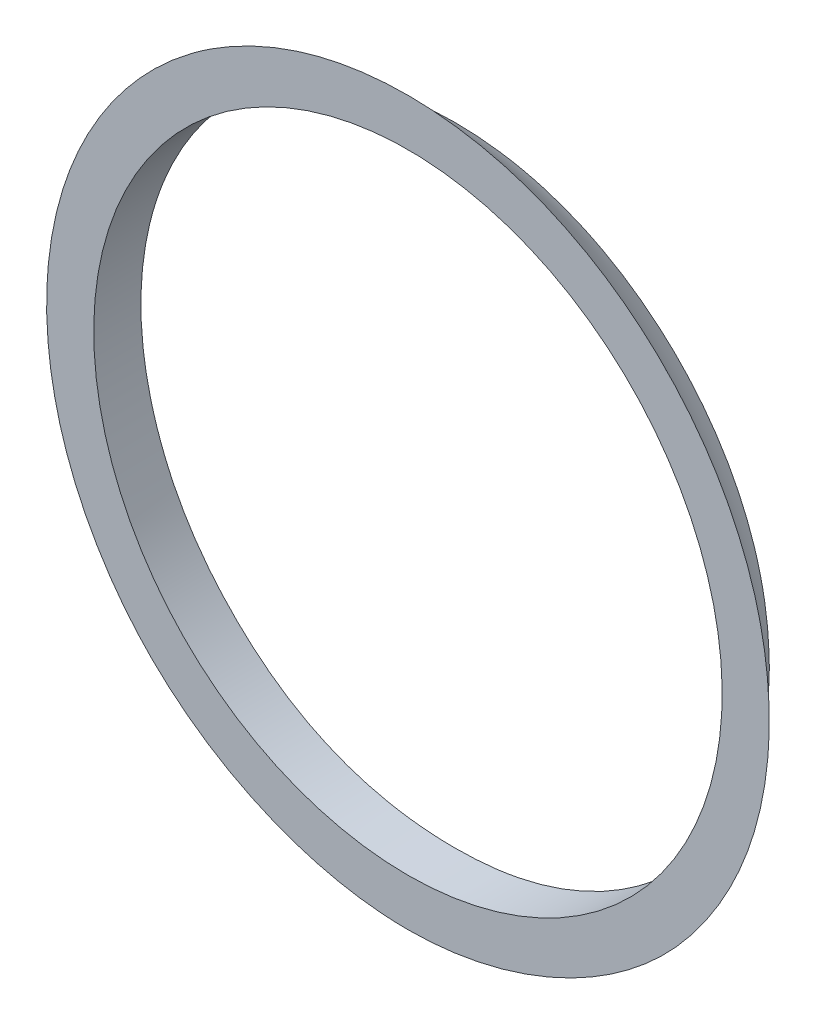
ISO-10303-21;
HEADER;
FILE_DESCRIPTION(('STEP AP214'),'2;1');
FILE_NAME('part.step','',(''),(''),'','','');
FILE_SCHEMA(('AUTOMOTIVE_DESIGN { 1 0 10303 214 1 1 1 1 }'));
ENDSEC;
DATA;
#1=APPLICATION_CONTEXT('core data for automotive mechanical design processes');
#2=APPLICATION_PROTOCOL_DEFINITION('international standard','automotive_design',2000,#1);
#3=PRODUCT_CONTEXT('',#1,'mechanical');
#4=PRODUCT('Part','Part','',(#3));
#5=PRODUCT_RELATED_PRODUCT_CATEGORY('part','',(#4));
#6=PRODUCT_DEFINITION_FORMATION('','',#4);
#7=PRODUCT_DEFINITION_CONTEXT('part definition',#1,'design');
#8=PRODUCT_DEFINITION('design','',#6,#7);
#9=PRODUCT_DEFINITION_SHAPE('','',#8);
#10=(LENGTH_UNIT() NAMED_UNIT(*) SI_UNIT(.MILLI.,.METRE.));
#11=(NAMED_UNIT(*) PLANE_ANGLE_UNIT() SI_UNIT($,.RADIAN.));
#12=(NAMED_UNIT(*) SI_UNIT($,.STERADIAN.) SOLID_ANGLE_UNIT());
#13=UNCERTAINTY_MEASURE_WITH_UNIT(LENGTH_MEASURE(1.E-05),#10,'distance_accuracy_value','');
#14=(GEOMETRIC_REPRESENTATION_CONTEXT(3) GLOBAL_UNCERTAINTY_ASSIGNED_CONTEXT((#13)) GLOBAL_UNIT_ASSIGNED_CONTEXT((#10,
#11,#12)) REPRESENTATION_CONTEXT('',''));
#15=CARTESIAN_POINT('',(0.,0.,0.));
#16=DIRECTION('',(0.,0.,1.));
#17=DIRECTION('',(1.,0.,0.));
#18=AXIS2_PLACEMENT_3D('',#15,#16,#17);
#19=CARTESIAN_POINT('',(370.257977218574,-413.045415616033,-147.499999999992));
#20=DIRECTION('',(0.,0.,1.));
#21=DIRECTION('',(-0.325224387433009,-0.945636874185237,0.));
#22=AXIS2_PLACEMENT_3D('',#19,#20,#21);
#23=PLANE('',#22);
#24=CARTESIAN_POINT('',(324.151711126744,-462.488037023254,-147.499999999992));
#25=CARTESIAN_POINT('',(324.77450577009,-462.488044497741,-147.499999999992));
#26=CARTESIAN_POINT('',(325.397181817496,-462.460550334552,-147.499999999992));
#27=CARTESIAN_POINT('',(326.638158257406,-462.352873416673,-147.499999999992));
#28=CARTESIAN_POINT('',(327.256457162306,-462.272673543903,-147.499999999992));
#29=CARTESIAN_POINT('',(328.485669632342,-462.061692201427,-147.499999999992));
#30=CARTESIAN_POINT('',(329.096564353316,-461.930801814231,-147.499999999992));
#31=CARTESIAN_POINT('',(330.305931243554,-461.620688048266,-147.499999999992));
#32=CARTESIAN_POINT('',(330.904404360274,-461.441468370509,-147.499999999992));
#33=CARTESIAN_POINT('',(331.887314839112,-461.104638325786,-147.499999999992));
#34=CARTESIAN_POINT('',(332.276233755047,-460.959931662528,-147.499999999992));
#35=CARTESIAN_POINT('',(333.046086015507,-460.650590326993,-147.499999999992));
#36=CARTESIAN_POINT('',(333.42701937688,-460.485955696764,-147.499999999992));
#37=CARTESIAN_POINT('',(334.17987943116,-460.137249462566,-147.499999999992));
#38=CARTESIAN_POINT('',(334.551806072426,-459.953177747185,-147.499999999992));
#39=CARTESIAN_POINT('',(335.285228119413,-459.566250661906,-147.499999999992));
#40=CARTESIAN_POINT('',(335.646734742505,-459.363416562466,-147.499999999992));
#41=CARTESIAN_POINT('',(336.358696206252,-458.939187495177,-147.499999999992));
#42=CARTESIAN_POINT('',(336.709150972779,-458.717792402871,-147.499999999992));
#43=CARTESIAN_POINT('',(337.397929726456,-458.256790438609,-147.499999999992));
#44=CARTESIAN_POINT('',(337.736252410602,-458.017181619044,-147.499999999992));
#45=CARTESIAN_POINT('',(338.426527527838,-457.499907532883,-147.499999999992));
#46=CARTESIAN_POINT('',(338.7773498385,-457.220732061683,-147.499999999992));
#47=CARTESIAN_POINT('',(339.461793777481,-456.641970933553,-147.499999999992));
#48=CARTESIAN_POINT('',(339.795415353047,-456.342385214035,-147.499999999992));
#49=CARTESIAN_POINT('',(340.281537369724,-455.878135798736,-147.499999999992));
#50=CARTESIAN_POINT('',(340.441192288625,-455.720908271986,-147.499999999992));
#51=CARTESIAN_POINT('',(340.755560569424,-455.401588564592,-147.499999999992));
#52=CARTESIAN_POINT('',(340.910273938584,-455.239496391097,-147.499999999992));
#53=CARTESIAN_POINT('',(341.366987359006,-454.746075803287,-147.499999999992));
#54=CARTESIAN_POINT('',(341.661444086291,-454.407714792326,-147.499999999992));
#55=CARTESIAN_POINT('',(342.229559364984,-453.71389262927,-147.499999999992));
#56=CARTESIAN_POINT('',(342.503214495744,-453.358428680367,-147.499999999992));
#57=CARTESIAN_POINT('',(342.897776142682,-452.81377200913,-147.499999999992));
#58=CARTESIAN_POINT('',(343.026647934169,-452.630302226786,-147.499999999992));
#59=CARTESIAN_POINT('',(343.279113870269,-452.259713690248,-147.499999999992));
#60=CARTESIAN_POINT('',(343.402706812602,-452.072594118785,-147.499999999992));
#61=CARTESIAN_POINT('',(343.864534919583,-451.351130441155,-147.499999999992));
#62=CARTESIAN_POINT('',(344.184059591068,-450.804610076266,-147.499999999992));
#63=CARTESIAN_POINT('',(344.777451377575,-449.687359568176,-147.499999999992));
#64=CARTESIAN_POINT('',(345.051315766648,-449.116627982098,-147.499999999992));
#65=CARTESIAN_POINT('',(345.550661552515,-447.954617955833,-147.499999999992));
#66=CARTESIAN_POINT('',(345.776162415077,-447.36334789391,-147.499999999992));
#67=CARTESIAN_POINT('',(346.176690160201,-446.163824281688,-147.499999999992));
#68=CARTESIAN_POINT('',(346.351713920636,-445.555569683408,-147.499999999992));
#69=CARTESIAN_POINT('',(346.5769076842,-444.628271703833,-147.499999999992));
#70=CARTESIAN_POINT('',(346.646203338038,-444.313750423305,-147.499999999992));
#71=CARTESIAN_POINT('',(346.771433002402,-443.682041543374,-147.499999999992));
#72=CARTESIAN_POINT('',(346.827367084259,-443.364853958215,-147.499999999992));
#73=CARTESIAN_POINT('',(346.926006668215,-442.728428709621,-147.499999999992));
#74=CARTESIAN_POINT('',(346.968711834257,-442.409190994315,-147.499999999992));
#75=CARTESIAN_POINT('',(347.040906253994,-441.769221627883,-147.499999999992));
#76=CARTESIAN_POINT('',(347.070395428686,-441.448489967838,-147.499999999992));
#77=CARTESIAN_POINT('',(347.116099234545,-440.805966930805,-147.499999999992));
#78=CARTESIAN_POINT('',(347.132309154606,-440.484175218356,-147.499999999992));
#79=CARTESIAN_POINT('',(347.15123130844,-439.84019798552,-147.499999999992));
#80=CARTESIAN_POINT('',(347.153943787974,-439.518012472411,-147.499999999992));
#81=CARTESIAN_POINT('',(347.145761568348,-438.873812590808,-147.499999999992));
#82=CARTESIAN_POINT('',(347.134866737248,-438.551798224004,-147.499999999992));
#83=CARTESIAN_POINT('',(347.099727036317,-437.908493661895,-147.499999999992));
#84=CARTESIAN_POINT('',(347.075481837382,-437.587203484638,-147.499999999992));
#85=CARTESIAN_POINT('',(347.013431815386,-436.942769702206,-147.499999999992));
#86=CARTESIAN_POINT('',(346.975496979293,-436.619638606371,-147.499999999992));
#87=CARTESIAN_POINT('',(346.886134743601,-435.975251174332,-147.499999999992));
#88=CARTESIAN_POINT('',(346.834707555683,-435.653994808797,-147.499999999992));
#89=CARTESIAN_POINT('',(346.71824849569,-435.013971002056,-147.499999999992));
#90=CARTESIAN_POINT('',(346.653217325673,-434.695203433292,-147.499999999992));
#91=CARTESIAN_POINT('',(346.509473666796,-434.060761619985,-147.499999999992));
#92=CARTESIAN_POINT('',(346.43076097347,-433.745087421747,-147.499999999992));
#93=CARTESIAN_POINT('',(346.25981041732,-433.117535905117,-147.499999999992));
#94=CARTESIAN_POINT('',(346.16757708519,-432.805657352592,-147.499999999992));
#95=CARTESIAN_POINT('',(345.969749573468,-432.186166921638,-147.499999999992));
#96=CARTESIAN_POINT('',(345.864155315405,-431.87855506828,-147.499999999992));
#97=CARTESIAN_POINT('',(345.63987318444,-431.268162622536,-147.499999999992));
#98=CARTESIAN_POINT('',(345.521186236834,-430.965381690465,-147.499999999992));
#99=CARTESIAN_POINT('',(345.271037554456,-430.365079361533,-147.499999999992));
#100=CARTESIAN_POINT('',(345.139572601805,-430.067559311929,-147.499999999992));
#101=CARTESIAN_POINT('',(344.729710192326,-429.190764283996,-147.499999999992));
#102=CARTESIAN_POINT('',(344.433120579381,-428.619862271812,-147.499999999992));
#103=CARTESIAN_POINT('',(343.793301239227,-427.504912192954,-147.499999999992));
#104=CARTESIAN_POINT('',(343.450071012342,-426.960864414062,-147.499999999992));
#105=CARTESIAN_POINT('',(342.719167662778,-425.903219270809,-147.499999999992));
#106=CARTESIAN_POINT('',(342.331481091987,-425.389631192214,-147.499999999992));
#107=CARTESIAN_POINT('',(341.514657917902,-424.39653076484,-147.499999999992));
#108=CARTESIAN_POINT('',(341.085519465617,-423.917019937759,-147.499999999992));
#109=CARTESIAN_POINT('',(340.184881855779,-422.991121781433,-147.499999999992));
#110=CARTESIAN_POINT('',(339.713036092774,-422.5450715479,-147.499999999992));
#111=CARTESIAN_POINT('',(338.733575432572,-421.694155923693,-147.499999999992));
#112=CARTESIAN_POINT('',(338.225961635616,-421.289289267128,-147.499999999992));
#113=CARTESIAN_POINT('',(337.178554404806,-420.523946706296,-147.499999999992));
#114=CARTESIAN_POINT('',(336.638770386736,-420.163457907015,-147.499999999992));
#115=CARTESIAN_POINT('',(335.530600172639,-419.489260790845,-147.499999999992));
#116=CARTESIAN_POINT('',(334.962212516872,-419.17555486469,-147.499999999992));
#117=CARTESIAN_POINT('',(334.091084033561,-418.741671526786,-147.499999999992));
#118=CARTESIAN_POINT('',(333.79738325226,-418.603063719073,-147.499999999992));
#119=CARTESIAN_POINT('',(333.204364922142,-418.338390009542,-147.499999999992));
#120=CARTESIAN_POINT('',(332.905047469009,-418.212323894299,-147.499999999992));
#121=CARTESIAN_POINT('',(332.301337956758,-417.97306561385,-147.499999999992));
#122=CARTESIAN_POINT('',(331.996946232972,-417.859872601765,-147.499999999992));
#123=CARTESIAN_POINT('',(331.383579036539,-417.646663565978,-147.499999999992));
#124=CARTESIAN_POINT('',(331.074603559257,-417.546647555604,-147.499999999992));
#125=CARTESIAN_POINT('',(330.452575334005,-417.360007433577,-147.499999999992));
#126=CARTESIAN_POINT('',(330.13952188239,-417.273385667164,-147.499999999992));
#127=CARTESIAN_POINT('',(329.509937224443,-417.113701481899,-147.499999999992));
#128=CARTESIAN_POINT('',(329.193405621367,-417.040640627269,-147.499999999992));
#129=CARTESIAN_POINT('',(328.557484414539,-416.908162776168,-147.499999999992));
#130=CARTESIAN_POINT('',(328.238094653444,-416.848746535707,-147.499999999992));
#131=CARTESIAN_POINT('',(327.597133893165,-416.743420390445,-147.499999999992));
#132=CARTESIAN_POINT('',(327.275563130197,-416.697509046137,-147.499999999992));
#133=CARTESIAN_POINT('',(326.634565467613,-416.619594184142,-147.499999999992));
#134=CARTESIAN_POINT('',(326.315157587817,-416.587434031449,-147.499999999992));
#135=CARTESIAN_POINT('',(325.675292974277,-416.53629735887,-147.499999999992));
#136=CARTESIAN_POINT('',(325.354836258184,-416.517320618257,-147.499999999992));
#137=CARTESIAN_POINT('',(324.713411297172,-416.492700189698,-147.499999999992));
#138=CARTESIAN_POINT('',(324.392443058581,-416.487056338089,-147.499999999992));
#139=CARTESIAN_POINT('',(323.750555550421,-416.489299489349,-147.499999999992));
#140=CARTESIAN_POINT('',(323.429636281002,-416.49718653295,-147.499999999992));
#141=CARTESIAN_POINT('',(322.788445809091,-416.526249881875,-147.499999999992));
#142=CARTESIAN_POINT('',(322.468174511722,-416.547424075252,-147.499999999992));
#143=CARTESIAN_POINT('',(321.828803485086,-416.602937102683,-147.499999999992));
#144=CARTESIAN_POINT('',(321.509703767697,-416.637276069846,-147.499999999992));
#145=CARTESIAN_POINT('',(320.554907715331,-416.759983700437,-147.499999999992));
#146=CARTESIAN_POINT('',(319.921563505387,-416.868049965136,-147.499999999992));
#147=CARTESIAN_POINT('',(318.975355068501,-417.071120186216,-147.499999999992));
#148=CARTESIAN_POINT('',(318.658100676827,-417.146399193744,-147.499999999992));
#149=CARTESIAN_POINT('',(318.027152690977,-417.31061014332,-147.499999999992));
#150=CARTESIAN_POINT('',(317.713458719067,-417.39954062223,-147.499999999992));
#151=CARTESIAN_POINT('',(317.090187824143,-417.590894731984,-147.499999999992));
#152=CARTESIAN_POINT('',(316.780611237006,-417.693319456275,-147.499999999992));
#153=CARTESIAN_POINT('',(316.166178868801,-417.911405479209,-147.499999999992));
#154=CARTESIAN_POINT('',(315.861323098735,-418.027066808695,-147.499999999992));
#155=CARTESIAN_POINT('',(314.954601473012,-418.393401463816,-147.499999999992));
#156=CARTESIAN_POINT('',(314.360438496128,-418.663469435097,-147.499999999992));
#157=CARTESIAN_POINT('',(313.197226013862,-419.252946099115,-147.499999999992));
#158=CARTESIAN_POINT('',(312.628176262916,-419.572354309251,-147.499999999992));
#159=CARTESIAN_POINT('',(311.527903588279,-420.252939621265,-147.499999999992));
#160=CARTESIAN_POINT('',(310.996227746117,-420.613384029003,-147.499999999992));
#161=CARTESIAN_POINT('',(309.96481803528,-421.377369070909,-147.499999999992));
#162=CARTESIAN_POINT('',(309.465083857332,-421.780909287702,-147.499999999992));
#163=CARTESIAN_POINT('',(308.500783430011,-422.628128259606,-147.499999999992));
#164=CARTESIAN_POINT('',(308.036221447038,-423.071811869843,-147.499999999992));
#165=CARTESIAN_POINT('',(307.145466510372,-423.996149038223,-147.499999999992));
#166=CARTESIAN_POINT('',(306.71927346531,-424.476802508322,-147.499999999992));
#167=CARTESIAN_POINT('',(305.903073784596,-425.478388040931,-147.499999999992));
#168=CARTESIAN_POINT('',(305.513609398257,-425.999762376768,-147.499999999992));
#169=CARTESIAN_POINT('',(304.780212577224,-427.073609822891,-147.499999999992));
#170=CARTESIAN_POINT('',(304.436281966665,-427.626084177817,-147.499999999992));
#171=CARTESIAN_POINT('',(303.796402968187,-428.758078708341,-147.499999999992));
#172=CARTESIAN_POINT('',(303.50044311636,-429.337592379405,-147.499999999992));
#173=CARTESIAN_POINT('',(303.094144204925,-430.223898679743,-147.499999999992));
#174=CARTESIAN_POINT('',(302.964976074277,-430.522197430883,-147.499999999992));
#175=CARTESIAN_POINT('',(302.719429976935,-431.124046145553,-147.499999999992));
#176=CARTESIAN_POINT('',(302.603052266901,-431.427596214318,-147.499999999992));
#177=CARTESIAN_POINT('',(302.38396866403,-432.03793428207,-147.499999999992));
#178=CARTESIAN_POINT('',(302.281199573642,-432.344699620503,-147.499999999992));
#179=CARTESIAN_POINT('',(302.088927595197,-432.962329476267,-147.499999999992));
#180=CARTESIAN_POINT('',(301.999423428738,-433.273193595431,-147.499999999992));
#181=CARTESIAN_POINT('',(301.833831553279,-433.898503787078,-147.499999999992));
#182=CARTESIAN_POINT('',(301.757745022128,-434.212950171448,-147.499999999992));
#183=CARTESIAN_POINT('',(301.619107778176,-434.844811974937,-147.499999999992));
#184=CARTESIAN_POINT('',(301.556557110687,-435.162227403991,-147.499999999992));
#185=CARTESIAN_POINT('',(301.444874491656,-435.799462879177,-147.499999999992));
#186=CARTESIAN_POINT('',(301.395744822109,-436.11928332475,-147.499999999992));
#187=CARTESIAN_POINT('',(301.310828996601,-436.76069109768,-147.499999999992));
#188=CARTESIAN_POINT('',(301.275042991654,-437.082278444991,-147.499999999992));
#189=CARTESIAN_POINT('',(301.216851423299,-437.726664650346,-147.499999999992));
#190=CARTESIAN_POINT('',(301.19444566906,-438.049463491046,-147.499999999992));
#191=CARTESIAN_POINT('',(301.16312476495,-438.695681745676,-147.499999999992));
#192=CARTESIAN_POINT('',(301.154209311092,-439.019101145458,-147.499999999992));
#193=CARTESIAN_POINT('',(301.148105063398,-439.987446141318,-147.499999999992));
#194=CARTESIAN_POINT('',(301.171357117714,-440.632663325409,-147.499999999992));
#195=CARTESIAN_POINT('',(301.246130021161,-441.597123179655,-147.499999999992));
#196=CARTESIAN_POINT('',(301.277710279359,-441.918091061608,-147.499999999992));
#197=CARTESIAN_POINT('',(301.354120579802,-442.558475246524,-147.499999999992));
#198=CARTESIAN_POINT('',(301.398950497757,-442.877891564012,-147.499999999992));
#199=CARTESIAN_POINT('',(301.501892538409,-443.514578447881,-147.499999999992));
#200=CARTESIAN_POINT('',(301.560004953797,-443.831848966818,-147.499999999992));
#201=CARTESIAN_POINT('',(301.689656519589,-444.463642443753,-147.499999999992));
#202=CARTESIAN_POINT('',(301.761195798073,-444.778165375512,-147.499999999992));
#203=CARTESIAN_POINT('',(301.917656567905,-445.403820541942,-147.499999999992));
#204=CARTESIAN_POINT('',(302.002576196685,-445.714953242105,-147.499999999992));
#205=CARTESIAN_POINT('',(302.185680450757,-446.333293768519,-147.499999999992));
#206=CARTESIAN_POINT('',(302.283865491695,-446.640501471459,-147.499999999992));
#207=CARTESIAN_POINT('',(302.528349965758,-447.352471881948,-147.499999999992));
#208=CARTESIAN_POINT('',(302.679757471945,-447.755491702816,-147.499999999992));
#209=CARTESIAN_POINT('',(303.005191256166,-448.552321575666,-147.499999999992));
#210=CARTESIAN_POINT('',(303.179219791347,-448.946130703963,-147.499999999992));
#211=CARTESIAN_POINT('',(303.549074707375,-449.723417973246,-147.499999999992));
#212=CARTESIAN_POINT('',(303.744903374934,-450.106895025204,-147.499999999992));
#213=CARTESIAN_POINT('',(304.157461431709,-450.862292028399,-147.499999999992));
#214=CARTESIAN_POINT('',(304.374183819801,-451.234215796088,-147.499999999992));
#215=CARTESIAN_POINT('',(304.714332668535,-451.782686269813,-147.499999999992));
#216=CARTESIAN_POINT('',(304.830228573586,-451.963943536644,-147.499999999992));
#217=CARTESIAN_POINT('',(305.066940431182,-452.323216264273,-147.499999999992));
#218=CARTESIAN_POINT('',(305.187756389,-452.501231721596,-147.499999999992));
#219=CARTESIAN_POINT('',(305.557516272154,-453.030138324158,-147.499999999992));
#220=CARTESIAN_POINT('',(305.813804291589,-453.375941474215,-147.499999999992));
#221=CARTESIAN_POINT('',(306.347470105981,-454.054602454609,-147.499999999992));
#222=CARTESIAN_POINT('',(306.624977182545,-454.387358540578,-147.499999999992));
#223=CARTESIAN_POINT('',(307.199080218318,-455.035987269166,-147.499999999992));
#224=CARTESIAN_POINT('',(307.49567575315,-455.351860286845,-147.499999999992));
#225=CARTESIAN_POINT('',(308.107229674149,-455.965265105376,-147.499999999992));
#226=CARTESIAN_POINT('',(308.422187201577,-456.262797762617,-147.499999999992));
#227=CARTESIAN_POINT('',(309.06896448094,-456.839072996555,-147.499999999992));
#228=CARTESIAN_POINT('',(309.400788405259,-457.117810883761,-147.499999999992));
#229=CARTESIAN_POINT('',(310.079753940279,-457.656037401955,-147.499999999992));
#230=CARTESIAN_POINT('',(310.42689732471,-457.915523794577,-147.499999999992));
#231=CARTESIAN_POINT('',(311.135051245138,-458.414788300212,-147.499999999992));
#232=CARTESIAN_POINT('',(311.496062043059,-458.654566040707,-147.499999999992));
#233=CARTESIAN_POINT('',(312.399944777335,-459.219881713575,-147.499999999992));
#234=CARTESIAN_POINT('',(312.949984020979,-459.534043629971,-147.499999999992));
#235=CARTESIAN_POINT('',(314.073036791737,-460.118005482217,-147.499999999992));
#236=CARTESIAN_POINT('',(314.646049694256,-460.387806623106,-147.499999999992));
#237=CARTESIAN_POINT('',(315.811270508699,-460.881360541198,-147.499999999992));
#238=CARTESIAN_POINT('',(316.403468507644,-461.105136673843,-147.499999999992));
#239=CARTESIAN_POINT('',(317.603610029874,-461.50487402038,-147.499999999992));
#240=CARTESIAN_POINT('',(318.211550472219,-461.680844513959,-147.499999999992));
#241=CARTESIAN_POINT('',(319.696580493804,-462.046077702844,-147.499999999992));
#242=CARTESIAN_POINT('',(320.58000430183,-462.210179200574,-147.499999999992));
#243=CARTESIAN_POINT('',(322.359612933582,-462.431102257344,-147.499999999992));
#244=CARTESIAN_POINT('',(323.25578474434,-462.48802627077,-147.499999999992));
#245=CARTESIAN_POINT('',(324.151711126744,-462.488037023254,-147.499999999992));
#246=B_SPLINE_CURVE_WITH_KNOTS('',3,(#24,#25,#26,#27,#28,#29,#30,#31,#32,#33,#34,#35,#36,#37,
#38,#39,#40,#41,#42,#43,#44,#45,#46,#47,#48,#49,#50,#51,#52,#53,#54,#55,#56,#57,#58,#59,#60,#61,
#62,#63,#64,#65,#66,#67,#68,#69,#70,#71,#72,#73,#74,#75,#76,#77,#78,#79,#80,#81,#82,#83,#84,#85,
#86,#87,#88,#89,#90,#91,#92,#93,#94,#95,#96,#97,#98,#99,#100,#101,#102,#103,#104,#105,#106,#107,
#108,#109,#110,#111,#112,#113,#114,#115,#116,#117,#118,#119,#120,#121,#122,#123,#124,#125,#126,
#127,#128,#129,#130,#131,#132,#133,#134,#135,#136,#137,#138,#139,#140,#141,#142,#143,#144,#145,
#146,#147,#148,#149,#150,#151,#152,#153,#154,#155,#156,#157,#158,#159,#160,#161,#162,#163,#164,
#165,#166,#167,#168,#169,#170,#171,#172,#173,#174,#175,#176,#177,#178,#179,#180,#181,#182,#183,
#184,#185,#186,#187,#188,#189,#190,#191,#192,#193,#194,#195,#196,#197,#198,#199,#200,#201,#202,
#203,#204,#205,#206,#207,#208,#209,#210,#211,#212,#213,#214,#215,#216,#217,#218,#219,#220,#221,
#222,#223,#224,#225,#226,#227,#228,#229,#230,#231,#232,#233,#234,#235,#236,#237,#238,#239,#240,
#241,#242,#243,#244,#245),.UNSPECIFIED.,.T.,.F.,(4,2,2,2,2,2,2,2,2,2,2,2,2,2,2,2,2,2,2,2,2,2,2,
2,2,2,2,2,2,2,2,2,2,2,2,2,2,2,2,2,2,2,2,2,2,2,2,2,2,2,2,2,2,2,2,2,2,2,2,2,2,2,2,2,2,2,2,2,2,2,2,
2,2,2,2,2,2,2,2,2,2,2,2,2,2,2,2,2,2,2,2,2,2,2,2,2,2,2,2,2,2,2,2,2,2,2,2,2,2,2,4),(0.,
1.86762920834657,3.73586529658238,5.60813809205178,7.48026755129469,8.72466558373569,
9.96906099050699,11.2134635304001,12.4564722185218,13.6994892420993,14.942639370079,
16.286918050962,17.6312008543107,18.3033361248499,18.9754704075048,20.3202221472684,
21.6651945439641,22.3377335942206,23.010425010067,24.9073292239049,26.8043466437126,
28.7005990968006,30.5969688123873,31.5629220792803,32.5288701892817,33.4948428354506,
34.460821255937,35.4271422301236,36.3934456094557,37.3597583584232,38.3260949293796,
39.3018615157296,40.2776127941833,41.2533137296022,42.2290292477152,43.2044185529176,
44.1798135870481,45.1551397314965,46.1307121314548,48.0582973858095,49.9859032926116,
51.9140938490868,53.8423704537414,55.7880081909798,57.7335861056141,59.6785973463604,
61.6237079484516,62.5977653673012,63.5718062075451,64.5457829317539,65.5197606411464,
66.4939086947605,67.4681690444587,68.4424833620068,69.4166937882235,70.3794909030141,
71.342271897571,72.3050410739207,73.2678131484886,74.2304322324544,75.1930610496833,
77.1178665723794,78.0958194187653,79.0736675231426,80.0515949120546,81.0295245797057,
82.9849371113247,84.9403305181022,86.8650925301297,88.7898359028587,90.7148123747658,
92.6397842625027,94.5897726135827,96.539839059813,98.4894387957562,99.4643913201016,
100.439363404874,101.409635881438,102.379814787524,103.350078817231,104.320346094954,
105.290778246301,106.261221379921,107.231650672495,108.202058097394,110.136251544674,
111.103604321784,112.070948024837,113.038313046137,114.005687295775,114.972927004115,
115.940197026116,117.231032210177,118.52199629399,119.813095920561,121.10376441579,
121.749120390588,122.394477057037,123.685007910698,124.984147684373,126.283258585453,
127.582308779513,128.881681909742,130.181205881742,131.480754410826,133.378949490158,
135.277092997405,137.174270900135,139.071080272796,141.76034577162,144.447039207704),.UNSPECIFIED.);
#247=CARTESIAN_POINT('',(324.151711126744,-462.488037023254,-147.499999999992));
#248=VERTEX_POINT('',#247);
#249=EDGE_CURVE('E61',#248,#248,#246,.T.);
#250=ORIENTED_EDGE('',*,*,#249,.T.);
#251=EDGE_LOOP('',(#250));
#252=FACE_BOUND('',#251,.T.);
#253=CARTESIAN_POINT('',(324.151711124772,-439.488037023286,-147.499999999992));
#254=DIRECTION('',(0.,0.,1.));
#255=DIRECTION('',(0.,-1.,0.));
#256=AXIS2_PLACEMENT_3D('',#253,#254,#255);
#257=CIRCLE('',#256,20.);
#258=CARTESIAN_POINT('',(324.151711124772,-459.488037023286,-147.499999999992));
#259=VERTEX_POINT('',#258);
#260=EDGE_CURVE('E71',#259,#259,#257,.T.);
#261=ORIENTED_EDGE('',*,*,#260,.F.);
#262=EDGE_LOOP('',(#261));
#263=FACE_BOUND('',#262,.T.);
#264=ADVANCED_FACE('F54',(#252,#263),#23,.T.);
#265=CARTESIAN_POINT('',(324.151711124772,-439.488037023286,-152.49999999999));
#266=DIRECTION('',(0.,0.,0.999999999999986));
#267=DIRECTION('',(0.782222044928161,0.622999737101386,0.));
#268=AXIS2_PLACEMENT_3D('',#265,#266,#267);
#269=CYLINDRICAL_SURFACE('',#268,20.);
#270=CARTESIAN_POINT('',(324.151711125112,-459.488037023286,-150.500000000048));
#271=CARTESIAN_POINT('',(323.590778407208,-459.488033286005,-150.500001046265));
#272=CARTESIAN_POINT('',(323.029741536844,-459.46441811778,-150.496684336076));
#273=CARTESIAN_POINT('',(321.911571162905,-459.37010822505,-150.48676199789));
#274=CARTESIAN_POINT('',(321.35443880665,-459.299400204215,-150.480155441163));
#275=CARTESIAN_POINT('',(320.247475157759,-459.111300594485,-150.466517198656));
#276=CARTESIAN_POINT('',(319.697652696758,-458.99385705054,-150.459485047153));
#277=CARTESIAN_POINT('',(318.609821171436,-458.71309635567,-150.447181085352));
#278=CARTESIAN_POINT('',(318.071811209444,-458.549782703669,-150.441909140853));
#279=CARTESIAN_POINT('',(317.188114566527,-458.240337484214,-150.435716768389));
#280=CARTESIAN_POINT('',(316.838040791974,-458.106592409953,-150.433931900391));
#281=CARTESIAN_POINT('',(316.145923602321,-457.819640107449,-150.431934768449));
#282=CARTESIAN_POINT('',(315.803880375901,-457.66643242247,-150.431722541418));
#283=CARTESIAN_POINT('',(315.128948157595,-457.341051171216,-150.432906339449));
#284=CARTESIAN_POINT('',(314.796059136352,-457.168877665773,-150.434302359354));
#285=CARTESIAN_POINT('',(314.140553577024,-456.806149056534,-150.438559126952));
#286=CARTESIAN_POINT('',(313.817934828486,-456.615597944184,-150.441419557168));
#287=CARTESIAN_POINT('',(313.183914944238,-456.216686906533,-150.448283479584));
#288=CARTESIAN_POINT('',(312.872513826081,-456.008326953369,-150.452286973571));
#289=CARTESIAN_POINT('',(312.261906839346,-455.574454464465,-150.460928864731));
#290=CARTESIAN_POINT('',(311.96270102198,-455.348941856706,-150.465567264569));
#291=CARTESIAN_POINT('',(311.37766423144,-454.881664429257,-150.47477417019));
#292=CARTESIAN_POINT('',(311.091822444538,-454.639913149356,-150.479342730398));
#293=CARTESIAN_POINT('',(310.534145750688,-454.140748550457,-150.487525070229));
#294=CARTESIAN_POINT('',(310.262310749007,-453.883335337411,-150.49113885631));
#295=CARTESIAN_POINT('',(309.733503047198,-453.353653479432,-150.496329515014));
#296=CARTESIAN_POINT('',(309.476530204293,-453.081384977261,-150.497906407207));
#297=CARTESIAN_POINT('',(308.978261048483,-452.522855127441,-150.49957066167));
#298=CARTESIAN_POINT('',(308.736965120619,-452.236593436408,-150.499657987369));
#299=CARTESIAN_POINT('',(308.270801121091,-451.650962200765,-150.499146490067));
#300=CARTESIAN_POINT('',(308.045933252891,-451.351592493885,-150.498547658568));
#301=CARTESIAN_POINT('',(307.721518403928,-450.893465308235,-150.497900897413));
#302=CARTESIAN_POINT('',(307.615524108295,-450.739238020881,-150.497727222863));
#303=CARTESIAN_POINT('',(307.407902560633,-450.42786786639,-150.497582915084));
#304=CARTESIAN_POINT('',(307.306275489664,-450.270724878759,-150.497612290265));
#305=CARTESIAN_POINT('',(306.908449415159,-449.63620950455,-150.498076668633));
#306=CARTESIAN_POINT('',(306.630007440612,-449.147521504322,-150.499205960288));
#307=CARTESIAN_POINT('',(306.11527885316,-448.148458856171,-150.502113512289));
#308=CARTESIAN_POINT('',(305.878992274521,-447.638084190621,-150.503891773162));
#309=CARTESIAN_POINT('',(305.557443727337,-446.859075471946,-150.506010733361));
#310=CARTESIAN_POINT('',(305.455731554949,-446.59713470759,-150.506625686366));
#311=CARTESIAN_POINT('',(305.263428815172,-446.069200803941,-150.507530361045));
#312=CARTESIAN_POINT('',(305.172838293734,-445.80320764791,-150.507820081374));
#313=CARTESIAN_POINT('',(304.918015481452,-444.999885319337,-150.508085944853));
#314=CARTESIAN_POINT('',(304.770683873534,-444.457096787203,-150.507459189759));
#315=CARTESIAN_POINT('',(304.522179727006,-443.360714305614,-150.5050032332));
#316=CARTESIAN_POINT('',(304.421034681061,-442.80711412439,-150.503173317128));
#317=CARTESIAN_POINT('',(304.304561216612,-441.971932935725,-150.501275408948));
#318=CARTESIAN_POINT('',(304.271609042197,-441.692711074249,-150.500783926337));
#319=CARTESIAN_POINT('',(304.217500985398,-441.133108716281,-150.500125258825));
#320=CARTESIAN_POINT('',(304.196345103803,-440.852728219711,-150.499958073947));
#321=CARTESIAN_POINT('',(304.165872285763,-440.29132975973,-150.499869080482));
#322=CARTESIAN_POINT('',(304.15655533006,-440.010311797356,-150.499947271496));
#323=CARTESIAN_POINT('',(304.149775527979,-439.448131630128,-150.499998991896));
#324=CARTESIAN_POINT('',(304.152312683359,-439.166969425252,-150.499972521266));
#325=CARTESIAN_POINT('',(304.16923696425,-438.605001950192,-150.499969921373));
#326=CARTESIAN_POINT('',(304.183624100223,-438.324196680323,-150.499993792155));
#327=CARTESIAN_POINT('',(304.224222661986,-437.763442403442,-150.500332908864));
#328=CARTESIAN_POINT('',(304.250434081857,-437.483493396,-150.500648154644));
#329=CARTESIAN_POINT('',(304.314635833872,-436.924938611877,-150.501581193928));
#330=CARTESIAN_POINT('',(304.352626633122,-436.646332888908,-150.50219899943));
#331=CARTESIAN_POINT('',(304.440319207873,-436.090970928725,-150.503601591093));
#332=CARTESIAN_POINT('',(304.490020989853,-435.814214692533,-150.504386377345));
#333=CARTESIAN_POINT('',(304.601047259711,-435.263043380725,-150.505759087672));
#334=CARTESIAN_POINT('',(304.662371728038,-434.988628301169,-150.506347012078));
#335=CARTESIAN_POINT('',(304.796534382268,-434.442626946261,-150.507186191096));
#336=CARTESIAN_POINT('',(304.86937256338,-434.171040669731,-150.507437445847));
#337=CARTESIAN_POINT('',(305.026433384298,-433.631179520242,-150.50758857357));
#338=CARTESIAN_POINT('',(305.110656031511,-433.362904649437,-150.507488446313));
#339=CARTESIAN_POINT('',(305.290334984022,-432.830145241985,-150.506985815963));
#340=CARTESIAN_POINT('',(305.385791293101,-432.565660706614,-150.506583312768));
#341=CARTESIAN_POINT('',(305.587771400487,-432.040946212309,-150.505615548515));
#342=CARTESIAN_POINT('',(305.694295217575,-431.780716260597,-150.505050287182));
#343=CARTESIAN_POINT('',(305.918208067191,-431.264994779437,-150.503920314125));
#344=CARTESIAN_POINT('',(306.035597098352,-431.009503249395,-150.503355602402));
#345=CARTESIAN_POINT('',(306.403767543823,-430.250809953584,-150.501695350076));
#346=CARTESIAN_POINT('',(306.670596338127,-429.755275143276,-150.500633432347));
#347=CARTESIAN_POINT('',(307.245012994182,-428.788512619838,-150.498634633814));
#348=CARTESIAN_POINT('',(307.552600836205,-428.317284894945,-150.49769775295));
#349=CARTESIAN_POINT('',(308.206387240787,-427.402396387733,-150.495925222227));
#350=CARTESIAN_POINT('',(308.552585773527,-426.958735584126,-150.49508957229));
#351=CARTESIAN_POINT('',(309.281123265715,-426.10215802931,-150.49392269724));
#352=CARTESIAN_POINT('',(309.663462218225,-425.6892412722,-150.49359147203));
#353=CARTESIAN_POINT('',(310.461580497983,-424.89706477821,-150.493650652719));
#354=CARTESIAN_POINT('',(310.877361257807,-424.517806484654,-150.494041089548));
#355=CARTESIAN_POINT('',(311.739398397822,-423.795662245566,-150.49529242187));
#356=CARTESIAN_POINT('',(312.18565478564,-423.452776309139,-150.49615331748));
#357=CARTESIAN_POINT('',(313.105447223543,-422.805823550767,-150.497952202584));
#358=CARTESIAN_POINT('',(313.578983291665,-422.501756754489,-150.49889019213));
#359=CARTESIAN_POINT('',(314.550058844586,-421.93456646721,-150.500904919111));
#360=CARTESIAN_POINT('',(315.047598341,-421.671442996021,-150.501981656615));
#361=CARTESIAN_POINT('',(315.80906188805,-421.308946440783,-150.503655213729));
#362=CARTESIAN_POINT('',(316.065438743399,-421.193467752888,-150.504222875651));
#363=CARTESIAN_POINT('',(316.582849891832,-420.973411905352,-150.505344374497));
#364=CARTESIAN_POINT('',(316.843884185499,-420.868834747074,-150.505898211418));
#365=CARTESIAN_POINT('',(317.370125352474,-420.670780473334,-150.506808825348));
#366=CARTESIAN_POINT('',(317.635332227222,-420.577303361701,-150.507165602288));
#367=CARTESIAN_POINT('',(318.169451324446,-420.401612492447,-150.507561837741));
#368=CARTESIAN_POINT('',(318.438363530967,-420.319398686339,-150.507601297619));
#369=CARTESIAN_POINT('',(318.979414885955,-420.166381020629,-150.507327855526));
#370=CARTESIAN_POINT('',(319.251554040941,-420.095577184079,-150.507014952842));
#371=CARTESIAN_POINT('',(319.798575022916,-419.965505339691,-150.506054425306));
#372=CARTESIAN_POINT('',(320.073456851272,-419.906237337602,-150.505406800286));
#373=CARTESIAN_POINT('',(320.625474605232,-419.799342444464,-150.503976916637));
#374=CARTESIAN_POINT('',(320.902610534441,-419.751715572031,-150.503194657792));
#375=CARTESIAN_POINT('',(321.458644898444,-419.668187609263,-150.501838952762));
#376=CARTESIAN_POINT('',(321.73754333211,-419.632286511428,-150.501265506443));
#377=CARTESIAN_POINT('',(322.296591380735,-419.572275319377,-150.500434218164));
#378=CARTESIAN_POINT('',(322.576740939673,-419.548164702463,-150.500176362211));
#379=CARTESIAN_POINT('',(323.137816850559,-419.511775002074,-150.499925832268));
#380=CARTESIAN_POINT('',(323.418743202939,-419.499495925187,-150.499933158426));
#381=CARTESIAN_POINT('',(323.840315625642,-419.489967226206,-150.499977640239));
#382=CARTESIAN_POINT('',(323.980874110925,-419.488272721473,-150.499998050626));
#383=CARTESIAN_POINT('',(324.261995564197,-419.487847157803,-150.500001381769));
#384=CARTESIAN_POINT('',(324.402558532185,-419.489116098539,-150.499984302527));
#385=CARTESIAN_POINT('',(324.824157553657,-419.497368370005,-150.499939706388));
#386=CARTESIAN_POINT('',(325.105119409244,-419.508796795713,-150.499918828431));
#387=CARTESIAN_POINT('',(325.666302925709,-419.543487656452,-150.500133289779));
#388=CARTESIAN_POINT('',(325.946524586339,-419.566750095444,-150.500368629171));
#389=CARTESIAN_POINT('',(326.505738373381,-419.625066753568,-150.501156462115));
#390=CARTESIAN_POINT('',(326.784730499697,-419.660120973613,-150.501708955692));
#391=CARTESIAN_POINT('',(327.34099436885,-419.741961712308,-150.5030365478));
#392=CARTESIAN_POINT('',(327.618266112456,-419.788748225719,-150.503811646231));
#393=CARTESIAN_POINT('',(328.170566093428,-419.893959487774,-150.505257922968));
#394=CARTESIAN_POINT('',(328.445594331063,-419.95238423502,-150.505929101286));
#395=CARTESIAN_POINT('',(329.266641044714,-420.144994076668,-150.507430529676));
#396=CARTESIAN_POINT('',(329.808742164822,-420.296532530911,-150.507749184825));
#397=CARTESIAN_POINT('',(330.610660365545,-420.557608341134,-150.507231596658));
#398=CARTESIAN_POINT('',(330.87612315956,-420.650273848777,-150.506893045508));
#399=CARTESIAN_POINT('',(331.402914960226,-420.846710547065,-150.50600785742));
#400=CARTESIAN_POINT('',(331.66424396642,-420.950481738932,-150.505461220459));
#401=CARTESIAN_POINT('',(332.441293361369,-421.278184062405,-150.503791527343));
#402=CARTESIAN_POINT('',(332.950195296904,-421.518542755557,-150.502638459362));
#403=CARTESIAN_POINT('',(333.945877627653,-422.041244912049,-150.50049637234));
#404=CARTESIAN_POINT('',(334.432658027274,-422.323588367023,-150.499507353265));
#405=CARTESIAN_POINT('',(335.380708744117,-422.928276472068,-150.497584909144));
#406=CARTESIAN_POINT('',(335.841979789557,-423.2506199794,-150.49665148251));
#407=CARTESIAN_POINT('',(336.735725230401,-423.933014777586,-150.495027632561));
#408=CARTESIAN_POINT('',(337.168199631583,-424.293066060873,-150.494337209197));
#409=CARTESIAN_POINT('',(338.001283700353,-425.048319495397,-150.493586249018));
#410=CARTESIAN_POINT('',(338.401893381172,-425.443521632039,-150.493525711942));
#411=CARTESIAN_POINT('',(339.168398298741,-426.266266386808,-150.49407592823));
#412=CARTESIAN_POINT('',(339.534293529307,-426.693809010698,-150.494686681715));
#413=CARTESIAN_POINT('',(340.228782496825,-427.578213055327,-150.496221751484));
#414=CARTESIAN_POINT('',(340.557374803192,-428.035075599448,-150.497146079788));
#415=CARTESIAN_POINT('',(341.174905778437,-428.974855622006,-150.499039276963));
#416=CARTESIAN_POINT('',(341.463844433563,-429.45777310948,-150.500008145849));
#417=CARTESIAN_POINT('',(342.000014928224,-430.446235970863,-150.502102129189));
#418=CARTESIAN_POINT('',(342.247246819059,-430.951781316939,-150.50322724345));
#419=CARTESIAN_POINT('',(342.698241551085,-431.981880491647,-150.505499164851));
#420=CARTESIAN_POINT('',(342.902004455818,-432.506434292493,-150.506645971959));
#421=CARTESIAN_POINT('',(343.264639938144,-433.570941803,-150.507714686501));
#422=CARTESIAN_POINT('',(343.42351066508,-434.110896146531,-150.507636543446));
#423=CARTESIAN_POINT('',(343.627254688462,-434.929272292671,-150.50646355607));
#424=CARTESIAN_POINT('',(343.689414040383,-435.203502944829,-150.50589647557));
#425=CARTESIAN_POINT('',(343.802122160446,-435.754359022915,-150.504546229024));
#426=CARTESIAN_POINT('',(343.852670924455,-436.030984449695,-150.503763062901));
#427=CARTESIAN_POINT('',(343.942059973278,-436.586116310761,-150.502342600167));
#428=CARTESIAN_POINT('',(343.980900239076,-436.864622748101,-150.501705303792));
#429=CARTESIAN_POINT('',(344.046805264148,-437.423027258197,-150.500730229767));
#430=CARTESIAN_POINT('',(344.073870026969,-437.702925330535,-150.500392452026));
#431=CARTESIAN_POINT('',(344.116175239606,-438.263613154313,-150.500012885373));
#432=CARTESIAN_POINT('',(344.131415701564,-438.544402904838,-150.499971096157));
#433=CARTESIAN_POINT('',(344.1500454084,-439.106375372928,-150.499967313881));
#434=CARTESIAN_POINT('',(344.153434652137,-439.387558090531,-150.500005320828));
#435=CARTESIAN_POINT('',(344.148355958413,-439.949803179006,-150.499958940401));
#436=CARTESIAN_POINT('',(344.139888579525,-440.230865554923,-150.499874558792));
#437=CARTESIAN_POINT('',(344.111112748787,-440.792383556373,-150.499934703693));
#438=CARTESIAN_POINT('',(344.090804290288,-441.072839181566,-150.500079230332));
#439=CARTESIAN_POINT('',(344.038382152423,-441.632645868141,-150.500693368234));
#440=CARTESIAN_POINT('',(344.006268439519,-441.911996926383,-150.501162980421));
#441=CARTESIAN_POINT('',(343.930293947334,-442.469093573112,-150.502386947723));
#442=CARTESIAN_POINT('',(343.88643321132,-442.746839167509,-150.503141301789));
#443=CARTESIAN_POINT('',(343.787039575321,-443.300240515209,-150.504676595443));
#444=CARTESIAN_POINT('',(343.73150667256,-443.575896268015,-150.505457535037));
#445=CARTESIAN_POINT('',(343.60887738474,-444.124603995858,-150.506737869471));
#446=CARTESIAN_POINT('',(343.541780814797,-444.397655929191,-150.50723725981));
#447=CARTESIAN_POINT('',(343.323297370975,-445.212206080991,-150.508163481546));
#448=CARTESIAN_POINT('',(343.154693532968,-445.749227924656,-150.508018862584));
#449=CARTESIAN_POINT('',(342.836558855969,-446.630666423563,-150.506603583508));
#450=CARTESIAN_POINT('',(342.699394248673,-446.979633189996,-150.505724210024));
#451=CARTESIAN_POINT('',(342.405660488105,-447.669342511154,-150.503723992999));
#452=CARTESIAN_POINT('',(342.249091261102,-448.010085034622,-150.50260314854));
#453=CARTESIAN_POINT('',(341.917058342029,-448.682218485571,-150.500531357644));
#454=CARTESIAN_POINT('',(341.741594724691,-449.01360945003,-150.499580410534));
#455=CARTESIAN_POINT('',(341.372316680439,-449.666013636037,-150.498172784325));
#456=CARTESIAN_POINT('',(341.178503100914,-449.987027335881,-150.497716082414));
#457=CARTESIAN_POINT('',(340.874508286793,-450.459964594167,-150.497591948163));
#458=CARTESIAN_POINT('',(340.770958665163,-450.616187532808,-150.497644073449));
#459=CARTESIAN_POINT('',(340.559509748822,-450.925661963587,-150.497925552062));
#460=CARTESIAN_POINT('',(340.451610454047,-451.078913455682,-150.498154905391));
#461=CARTESIAN_POINT('',(340.121519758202,-451.534018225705,-150.498880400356));
#462=CARTESIAN_POINT('',(339.892914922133,-451.831253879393,-150.499414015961));
#463=CARTESIAN_POINT('',(339.419359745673,-452.412409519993,-150.499611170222));
#464=CARTESIAN_POINT('',(339.174409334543,-452.696329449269,-150.499274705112));
#465=CARTESIAN_POINT('',(338.795337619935,-453.111521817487,-150.497559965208));
#466=CARTESIAN_POINT('',(338.667032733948,-453.248144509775,-150.496786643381));
#467=CARTESIAN_POINT('',(338.406636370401,-453.517727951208,-150.494751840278));
#468=CARTESIAN_POINT('',(338.27454489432,-453.650688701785,-150.493490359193));
#469=CARTESIAN_POINT('',(337.872748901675,-454.04391421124,-150.489012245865));
#470=CARTESIAN_POINT('',(337.59749900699,-454.298548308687,-150.485101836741));
#471=CARTESIAN_POINT('',(337.033082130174,-454.791985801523,-150.476535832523));
#472=CARTESIAN_POINT('',(336.743911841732,-455.030785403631,-150.471880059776));
#473=CARTESIAN_POINT('',(336.152602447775,-455.491759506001,-150.462662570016));
#474=CARTESIAN_POINT('',(335.850463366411,-455.713934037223,-150.458100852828));
#475=CARTESIAN_POINT('',(335.234175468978,-456.140950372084,-150.449737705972));
#476=CARTESIAN_POINT('',(334.920026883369,-456.345792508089,-150.445936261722));
#477=CARTESIAN_POINT('',(334.280749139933,-456.737474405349,-150.439562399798));
#478=CARTESIAN_POINT('',(333.955621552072,-456.92431672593,-150.43698980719));
#479=CARTESIAN_POINT('',(333.295365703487,-457.279442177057,-150.433356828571));
#480=CARTESIAN_POINT('',(332.960237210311,-457.447724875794,-150.432296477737));
#481=CARTESIAN_POINT('',(332.281030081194,-457.765200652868,-150.431792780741));
#482=CARTESIAN_POINT('',(331.936950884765,-457.914392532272,-150.432349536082));
#483=CARTESIAN_POINT('',(331.241332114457,-458.193049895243,-150.435010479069));
#484=CARTESIAN_POINT('',(330.889800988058,-458.322536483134,-150.437112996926));
#485=CARTESIAN_POINT('',(330.180058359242,-458.561558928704,-150.442626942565));
#486=CARTESIAN_POINT('',(329.821847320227,-458.671096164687,-150.446038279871));
#487=CARTESIAN_POINT('',(329.099946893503,-458.869860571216,-150.453768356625));
#488=CARTESIAN_POINT('',(328.736259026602,-458.959093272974,-150.458086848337));
#489=CARTESIAN_POINT('',(328.024139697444,-459.112760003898,-150.466829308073));
#490=CARTESIAN_POINT('',(327.675939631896,-459.17826961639,-150.471235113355));
#491=CARTESIAN_POINT('',(326.976492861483,-459.290716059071,-150.479758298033));
#492=CARTESIAN_POINT('',(326.625245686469,-459.337649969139,-150.483875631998));
#493=CARTESIAN_POINT('',(325.920800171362,-459.412789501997,-150.4911122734));
#494=CARTESIAN_POINT('',(325.567602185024,-459.440998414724,-150.494231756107));
#495=CARTESIAN_POINT('',(324.860187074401,-459.478624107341,-150.49867536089));
#496=CARTESIAN_POINT('',(324.50596987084,-459.488039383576,-150.499999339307));
#497=CARTESIAN_POINT('',(324.151711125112,-459.488037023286,-150.500000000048));
#498=B_SPLINE_CURVE_WITH_KNOTS('',3,(#270,#271,#272,#273,#274,#275,#276,#277,#278,#279,#280,
#281,#282,#283,#284,#285,#286,#287,#288,#289,#290,#291,#292,#293,#294,#295,#296,#297,#298,#299,
#300,#301,#302,#303,#304,#305,#306,#307,#308,#309,#310,#311,#312,#313,#314,#315,#316,#317,#318,
#319,#320,#321,#322,#323,#324,#325,#326,#327,#328,#329,#330,#331,#332,#333,#334,#335,#336,#337,
#338,#339,#340,#341,#342,#343,#344,#345,#346,#347,#348,#349,#350,#351,#352,#353,#354,#355,#356,
#357,#358,#359,#360,#361,#362,#363,#364,#365,#366,#367,#368,#369,#370,#371,#372,#373,#374,#375,
#376,#377,#378,#379,#380,#381,#382,#383,#384,#385,#386,#387,#388,#389,#390,#391,#392,#393,#394,
#395,#396,#397,#398,#399,#400,#401,#402,#403,#404,#405,#406,#407,#408,#409,#410,#411,#412,#413,
#414,#415,#416,#417,#418,#419,#420,#421,#422,#423,#424,#425,#426,#427,#428,#429,#430,#431,#432,
#433,#434,#435,#436,#437,#438,#439,#440,#441,#442,#443,#444,#445,#446,#447,#448,#449,#450,#451,
#452,#453,#454,#455,#456,#457,#458,#459,#460,#461,#462,#463,#464,#465,#466,#467,#468,#469,#470,
#471,#472,#473,#474,#475,#476,#477,#478,#479,#480,#481,#482,#483,#484,#485,#486,#487,#488,#489,
#490,#491,#492,#493,#494,#495,#496,#497),.UNSPECIFIED.,.T.,.F.,(4,2,2,2,2,2,2,2,2,2,2,2,2,2,2,2,
2,2,2,2,2,2,2,2,2,2,2,2,2,2,2,2,2,2,2,2,2,2,2,2,2,2,2,2,2,2,2,2,2,2,2,2,2,2,2,2,2,2,2,2,2,2,2,2,
2,2,2,2,2,2,2,2,2,2,2,2,2,2,2,2,2,2,2,2,2,2,2,2,2,2,2,2,2,2,2,2,2,2,2,2,2,2,2,2,2,2,2,2,2,2,2,2,
2,4),(0.,1.68248513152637,3.36544550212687,5.05028203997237,6.7349900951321,7.85871906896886,
8.98247441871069,10.106226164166,11.2297343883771,12.3532443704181,13.4767590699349,
14.5993483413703,15.7219300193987,16.8445009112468,17.9670993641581,19.0897117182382,
19.6510611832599,20.2124338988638,21.8975910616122,23.5827495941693,24.4255175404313,
25.2682889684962,26.9534549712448,28.6396227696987,29.48289421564,30.3261657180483,
31.1694358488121,32.0127061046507,32.8559771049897,33.6992476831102,34.5425517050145,
35.3858561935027,36.229159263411,37.0724619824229,37.9157652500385,38.7590688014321,
39.6023737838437,40.4456786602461,42.1319220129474,43.8181645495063,45.5044057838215,
47.1906466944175,48.8769598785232,50.5632734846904,52.2495882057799,53.9359037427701,
54.7792529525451,55.6226022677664,56.4659518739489,57.309297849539,58.1526455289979,
58.9959936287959,59.8393430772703,60.6826919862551,61.5260035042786,62.36931549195,
62.7909946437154,63.2126737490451,64.0559849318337,64.8992963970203,65.7426079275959,
66.5859190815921,67.4292301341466,69.115487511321,69.9588042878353,70.8021211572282,
72.4883801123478,74.174638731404,75.8608491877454,77.5470593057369,79.2332687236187,
80.9194784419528,82.6057528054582,84.2920277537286,85.9783006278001,87.664571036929,
89.3509109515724,90.1942697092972,91.0376287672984,91.8809891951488,92.7243493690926,
93.5677086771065,94.411068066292,95.2543877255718,96.0977078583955,96.941030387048,
97.7843498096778,98.6276694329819,99.4710025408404,101.157275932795,102.281636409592,
103.406001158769,104.530361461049,105.654669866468,106.216881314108,106.779092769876,
107.903401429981,109.027714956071,109.589927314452,110.152139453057,111.276457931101,
112.401044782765,113.525629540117,114.650192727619,115.774595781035,116.899024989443,
118.023524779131,119.146811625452,120.27002083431,121.392923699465,122.45543703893,
123.518117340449,124.580610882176,125.643189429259),.UNSPECIFIED.);
#499=CARTESIAN_POINT('',(324.151711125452,-459.488037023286,-150.500000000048));
#500=VERTEX_POINT('',#499);
#501=EDGE_CURVE('E11',#500,#500,#498,.T.);
#502=ORIENTED_EDGE('',*,*,#501,.T.);
#503=EDGE_LOOP('',(#502));
#504=FACE_BOUND('',#503,.T.);
#505=ORIENTED_EDGE('',*,*,#260,.T.);
#506=EDGE_LOOP('',(#505));
#507=FACE_BOUND('',#506,.T.);
#508=ADVANCED_FACE('F75',(#504,#507),#269,.F.);
#509=CARTESIAN_POINT('',(324.151711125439,-459.465833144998,-150.536152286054));
#510=CARTESIAN_POINT('',(329.390057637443,-459.465833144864,-150.536152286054));
#511=CARTESIAN_POINT('',(335.937990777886,-456.66769752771,-150.536152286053));
#512=CARTESIAN_POINT('',(340.811685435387,-450.72784793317,-150.536152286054));
#513=CARTESIAN_POINT('',(342.672487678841,-447.318083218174,-150.536152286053));
#514=CARTESIAN_POINT('',(343.849512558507,-443.566605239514,-150.536152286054));
#515=CARTESIAN_POINT('',(344.269444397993,-439.488037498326,-150.536152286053));
#516=CARTESIAN_POINT('',(343.849753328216,-435.409466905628,-150.536152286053));
#517=CARTESIAN_POINT('',(342.671524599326,-431.657997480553,-150.536152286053));
#518=CARTESIAN_POINT('',(340.815296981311,-428.248201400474,-150.536152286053));
#519=CARTESIAN_POINT('',(338.361354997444,-425.278393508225,-150.536152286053));
#520=CARTESIAN_POINT('',(335.391546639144,-422.824449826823,-150.536152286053));
#521=CARTESIAN_POINT('',(331.981750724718,-420.968228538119,-150.536152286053));
#522=CARTESIAN_POINT('',(328.23028110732,-419.789976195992,-150.536152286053));
#523=CARTESIAN_POINT('',(324.151711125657,-419.370373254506,-150.536152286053));
#524=CARTESIAN_POINT('',(320.073141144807,-419.789976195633,-150.536152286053));
#525=CARTESIAN_POINT('',(316.321671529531,-420.968228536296,-150.536152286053));
#526=CARTESIAN_POINT('',(312.911875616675,-422.824449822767,-150.536152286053));
#527=CARTESIAN_POINT('',(309.942067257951,-425.278393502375,-150.536152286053));
#528=CARTESIAN_POINT('',(307.488125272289,-428.248201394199,-150.536152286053));
#529=CARTESIAN_POINT('',(305.631897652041,-431.657997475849,-150.536152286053));
#530=CARTESIAN_POINT('',(304.453668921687,-435.409466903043,-150.536152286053));
#531=CARTESIAN_POINT('',(304.033977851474,-439.488037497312,-150.536152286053));
#532=CARTESIAN_POINT('',(304.453909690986,-443.566605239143,-150.536152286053));
#533=CARTESIAN_POINT('',(305.630934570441,-447.318083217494,-150.536152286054));
#534=CARTESIAN_POINT('',(307.491736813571,-450.727847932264,-150.536152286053));
#535=CARTESIAN_POINT('',(312.365431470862,-456.667697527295,-150.536152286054));
#536=CARTESIAN_POINT('',(318.913364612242,-459.465833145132,-150.536152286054));
#537=CARTESIAN_POINT('',(324.151711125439,-459.465833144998,-150.536152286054));
#538=CARTESIAN_POINT('',(324.151711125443,-459.473234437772,-150.524101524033));
#539=CARTESIAN_POINT('',(329.392000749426,-459.473234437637,-150.524101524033));
#540=CARTESIAN_POINT('',(335.942362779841,-456.674050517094,-150.524101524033));
#541=CARTESIAN_POINT('',(340.817852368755,-450.732020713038,-150.524101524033));
#542=CARTESIAN_POINT('',(342.679345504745,-447.321001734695,-150.524101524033));
#543=CARTESIAN_POINT('',(343.856808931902,-443.568136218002,-150.524101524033));
#544=CARTESIAN_POINT('',(344.276898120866,-439.488037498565,-150.524101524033));
#545=CARTESIAN_POINT('',(343.857049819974,-435.40793592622,-150.524101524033));
#546=CARTESIAN_POINT('',(342.678381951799,-431.65507896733,-150.524101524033));
#547=CARTESIAN_POINT('',(340.821465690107,-428.244028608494,-150.524101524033));
#548=CARTESIAN_POINT('',(338.366617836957,-425.273130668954,-150.524101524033));
#549=CARTESIAN_POINT('',(335.395719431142,-422.818281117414,-150.524101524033));
#550=CARTESIAN_POINT('',(331.984669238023,-420.96137118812,-150.524101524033));
#551=CARTESIAN_POINT('',(328.231812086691,-419.782679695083,-150.524101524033));
#552=CARTESIAN_POINT('',(324.151711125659,-419.362919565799,-150.524101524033));
#553=CARTESIAN_POINT('',(320.071610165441,-419.782679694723,-150.524101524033));
#554=CARTESIAN_POINT('',(316.318753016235,-420.961371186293,-150.524101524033));
#555=CARTESIAN_POINT('',(312.907702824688,-422.81828111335,-150.524101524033));
#556=CARTESIAN_POINT('',(309.936804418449,-425.273130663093,-150.524101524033));
#557=CARTESIAN_POINT('',(307.481956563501,-428.244028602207,-150.524101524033));
#558=CARTESIAN_POINT('',(305.625040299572,-431.655078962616,-150.524101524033));
#559=CARTESIAN_POINT('',(304.44637242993,-435.40793592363,-150.524101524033));
#560=CARTESIAN_POINT('',(304.0265241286,-439.488037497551,-150.524101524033));
#561=CARTESIAN_POINT('',(304.446613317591,-443.568136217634,-150.524101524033));
#562=CARTESIAN_POINT('',(305.624076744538,-447.321001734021,-150.524101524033));
#563=CARTESIAN_POINT('',(307.485569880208,-450.73202071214,-150.524101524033));
#564=CARTESIAN_POINT('',(312.361059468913,-456.674050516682,-150.524101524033));
#565=CARTESIAN_POINT('',(318.911421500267,-459.473234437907,-150.524101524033));
#566=CARTESIAN_POINT('',(324.151711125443,-459.473234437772,-150.524101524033));
#567=CARTESIAN_POINT('',(324.151711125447,-459.480635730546,-150.512050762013));
#568=CARTESIAN_POINT('',(329.393943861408,-459.48063573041,-150.512050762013));
#569=CARTESIAN_POINT('',(335.946734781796,-456.680403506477,-150.512050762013));
#570=CARTESIAN_POINT('',(340.824019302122,-450.736193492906,-150.512050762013));
#571=CARTESIAN_POINT('',(342.686203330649,-447.323920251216,-150.512050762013));
#572=CARTESIAN_POINT('',(343.864105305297,-443.56966719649,-150.512050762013));
#573=CARTESIAN_POINT('',(344.284351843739,-439.488037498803,-150.512050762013));
#574=CARTESIAN_POINT('',(343.864346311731,-435.406404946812,-150.512050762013));
#575=CARTESIAN_POINT('',(342.685239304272,-431.652160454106,-150.512050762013));
#576=CARTESIAN_POINT('',(340.827634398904,-428.239855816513,-150.512050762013));
#577=CARTESIAN_POINT('',(338.37188067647,-425.267867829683,-150.512050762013));
#578=CARTESIAN_POINT('',(335.39989222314,-422.812112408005,-150.512050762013));
#579=CARTESIAN_POINT('',(331.987587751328,-420.95451383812,-150.512050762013));
#580=CARTESIAN_POINT('',(328.233343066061,-419.775383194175,-150.512050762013));
#581=CARTESIAN_POINT('',(324.151711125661,-419.355465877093,-150.512050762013));
#582=CARTESIAN_POINT('',(320.070079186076,-419.775383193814,-150.512050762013));
#583=CARTESIAN_POINT('',(316.315834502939,-420.95451383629,-150.512050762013));
#584=CARTESIAN_POINT('',(312.903530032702,-422.812112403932,-150.512050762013));
#585=CARTESIAN_POINT('',(309.931541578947,-425.26786782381,-150.512050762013));
#586=CARTESIAN_POINT('',(307.475787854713,-428.239855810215,-150.512050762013));
#587=CARTESIAN_POINT('',(305.618182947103,-431.652160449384,-150.512050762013));
#588=CARTESIAN_POINT('',(304.439075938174,-435.406404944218,-150.512050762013));
#589=CARTESIAN_POINT('',(304.019070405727,-439.488037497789,-150.512050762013));
#590=CARTESIAN_POINT('',(304.439316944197,-443.569667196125,-150.512050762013));
#591=CARTESIAN_POINT('',(305.617218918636,-447.323920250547,-150.512050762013));
#592=CARTESIAN_POINT('',(307.479402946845,-450.736193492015,-150.512050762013));
#593=CARTESIAN_POINT('',(312.356687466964,-456.680403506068,-150.512050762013));
#594=CARTESIAN_POINT('',(318.909478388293,-459.480635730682,-150.512050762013));
#595=CARTESIAN_POINT('',(324.151711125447,-459.480635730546,-150.512050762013));
#596=CARTESIAN_POINT('',(324.151711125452,-459.48803702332,-150.499999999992));
#597=CARTESIAN_POINT('',(329.395886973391,-459.488037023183,-150.499999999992));
#598=CARTESIAN_POINT('',(335.951106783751,-456.68675649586,-150.499999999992));
#599=CARTESIAN_POINT('',(340.83018623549,-450.740366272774,-150.499999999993));
#600=CARTESIAN_POINT('',(342.693061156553,-447.326838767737,-150.499999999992));
#601=CARTESIAN_POINT('',(343.871401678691,-443.571198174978,-150.499999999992));
#602=CARTESIAN_POINT('',(344.291805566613,-439.488037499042,-150.499999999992));
#603=CARTESIAN_POINT('',(343.871642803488,-435.404873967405,-150.499999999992));
#604=CARTESIAN_POINT('',(342.692096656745,-431.649241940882,-150.499999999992));
#605=CARTESIAN_POINT('',(340.8338031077,-428.235683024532,-150.499999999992));
#606=CARTESIAN_POINT('',(338.377143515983,-425.262604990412,-150.499999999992));
#607=CARTESIAN_POINT('',(335.404065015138,-422.805943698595,-150.499999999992));
#608=CARTESIAN_POINT('',(331.990506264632,-420.947656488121,-150.499999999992));
#609=CARTESIAN_POINT('',(328.234874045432,-419.768086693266,-150.499999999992));
#610=CARTESIAN_POINT('',(324.151711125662,-419.348012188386,-150.499999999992));
#611=CARTESIAN_POINT('',(320.06854820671,-419.768086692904,-150.499999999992));
#612=CARTESIAN_POINT('',(316.312915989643,-420.947656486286,-150.499999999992));
#613=CARTESIAN_POINT('',(312.899357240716,-422.805943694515,-150.499999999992));
#614=CARTESIAN_POINT('',(309.926278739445,-425.262604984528,-150.499999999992));
#615=CARTESIAN_POINT('',(307.469619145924,-428.235683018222,-150.499999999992));
#616=CARTESIAN_POINT('',(305.611325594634,-431.649241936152,-150.499999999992));
#617=CARTESIAN_POINT('',(304.431779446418,-435.404873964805,-150.499999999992));
#618=CARTESIAN_POINT('',(304.011616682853,-439.488037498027,-150.499999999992));
#619=CARTESIAN_POINT('',(304.432020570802,-443.571198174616,-150.499999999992));
#620=CARTESIAN_POINT('',(305.610361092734,-447.326838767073,-150.499999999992));
#621=CARTESIAN_POINT('',(307.473236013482,-450.74036627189,-150.499999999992));
#622=CARTESIAN_POINT('',(312.352315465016,-456.686756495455,-150.499999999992));
#623=CARTESIAN_POINT('',(318.907535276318,-459.488037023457,-150.499999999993));
#624=CARTESIAN_POINT('',(324.151711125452,-459.48803702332,-150.499999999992));
#625=CARTESIAN_POINT('',(324.151711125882,-460.241936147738,-149.272503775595));
#626=CARTESIAN_POINT('',(329.593813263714,-460.241936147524,-149.272503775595));
#627=CARTESIAN_POINT('',(336.396440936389,-457.333874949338,-149.272503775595));
#628=CARTESIAN_POINT('',(341.458352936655,-451.165407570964,-149.272503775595));
#629=CARTESIAN_POINT('',(343.39160249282,-447.624120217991,-149.272503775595));
#630=CARTESIAN_POINT('',(344.614613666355,-443.727144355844,-149.272503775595));
#631=CARTESIAN_POINT('',(345.051045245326,-439.488037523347,-149.272503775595));
#632=CARTESIAN_POINT('',(344.614866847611,-435.24892769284,-149.272503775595));
#633=CARTESIAN_POINT('',(343.390589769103,-431.351960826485,-149.272503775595));
#634=CARTESIAN_POINT('',(341.462150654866,-427.810640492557,-149.272503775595));
#635=CARTESIAN_POINT('',(338.913218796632,-424.726529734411,-149.272503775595));
#636=CARTESIAN_POINT('',(335.829107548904,-422.177596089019,-149.272503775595));
#637=CARTESIAN_POINT('',(332.287787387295,-420.249163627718,-149.272503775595));
#638=CARTESIAN_POINT('',(328.390820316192,-419.02486171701,-149.272503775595));
#639=CARTESIAN_POINT('',(324.151711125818,-418.58877598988,-149.272503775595));
#640=CARTESIAN_POINT('',(319.912601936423,-419.024861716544,-149.272503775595));
#641=CARTESIAN_POINT('',(316.015634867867,-420.249163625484,-149.272503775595));
#642=CARTESIAN_POINT('',(312.474314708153,-422.177596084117,-149.272503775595));
#643=CARTESIAN_POINT('',(309.390203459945,-424.72652972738,-149.272503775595));
#644=CARTESIAN_POINT('',(306.841271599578,-427.810640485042,-149.272503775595));
#645=CARTESIAN_POINT('',(304.912832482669,-431.35196082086,-149.272503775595));
#646=CARTESIAN_POINT('',(303.688555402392,-435.248927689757,-149.272503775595));
#647=CARTESIAN_POINT('',(303.252377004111,-439.488037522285,-149.272503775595));
#648=CARTESIAN_POINT('',(303.688808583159,-443.727144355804,-149.272503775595));
#649=CARTESIAN_POINT('',(304.911819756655,-447.624120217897,-149.272503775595));
#650=CARTESIAN_POINT('',(306.845069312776,-451.165407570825,-149.272503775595));
#651=CARTESIAN_POINT('',(311.906981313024,-457.333874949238,-149.272503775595));
#652=CARTESIAN_POINT('',(318.709608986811,-460.241936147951,-149.272503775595));
#653=CARTESIAN_POINT('',(324.151711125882,-460.241936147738,-149.272503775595));
#654=CARTESIAN_POINT('',(324.151711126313,-461.260540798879,-148.253899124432));
#655=CARTESIAN_POINT('',(329.860881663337,-461.260540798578,-148.253899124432));
#656=CARTESIAN_POINT('',(336.997344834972,-458.209899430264,-148.253899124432));
#657=CARTESIAN_POINT('',(342.307831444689,-451.738424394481,-148.253899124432));
#658=CARTESIAN_POINT('',(344.33594603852,-448.02321627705,-148.253899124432));
#659=CARTESIAN_POINT('',(345.61895123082,-443.934947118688,-148.253899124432));
#660=CARTESIAN_POINT('',(346.076780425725,-439.488037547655,-148.253899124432));
#661=CARTESIAN_POINT('',(345.619216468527,-435.041124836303,-148.253899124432));
#662=CARTESIAN_POINT('',(344.334885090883,-430.95286510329,-148.253899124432));
#663=CARTESIAN_POINT('',(342.311810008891,-427.237622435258,-148.253899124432));
#664=CARTESIAN_POINT('',(339.63773485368,-424.002013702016,-148.253899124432));
#665=CARTESIAN_POINT('',(336.402125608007,-421.327936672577,-148.253899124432));
#666=CARTESIAN_POINT('',(332.68688311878,-419.304868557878,-148.253899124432));
#667=CARTESIAN_POINT('',(328.598623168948,-418.020511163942,-148.253899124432));
#668=CARTESIAN_POINT('',(324.15171112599,-417.563044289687,-148.253899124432));
#669=CARTESIAN_POINT('',(319.704799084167,-418.020511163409,-148.253899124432));
#670=CARTESIAN_POINT('',(315.61653913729,-419.304868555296,-148.253899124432));
#671=CARTESIAN_POINT('',(311.901296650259,-421.327936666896,-148.253899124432));
#672=CARTESIAN_POINT('',(308.665687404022,-424.002013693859,-148.253899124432));
#673=CARTESIAN_POINT('',(305.991612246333,-427.237622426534,-148.253899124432));
#674=CARTESIAN_POINT('',(303.968537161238,-430.952865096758,-148.253899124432));
#675=CARTESIAN_POINT('',(302.684205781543,-435.04112483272,-148.253899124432));
#676=CARTESIAN_POINT('',(302.226641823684,-439.488037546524,-148.253899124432));
#677=CARTESIAN_POINT('',(302.684471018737,-443.934947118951,-148.253899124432));
#678=CARTESIAN_POINT('',(303.967476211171,-448.023216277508,-148.253899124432));
#679=CARTESIAN_POINT('',(305.995590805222,-451.73842439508,-148.253899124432));
#680=CARTESIAN_POINT('',(311.306077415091,-458.209899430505,-148.253899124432));
#681=CARTESIAN_POINT('',(318.442540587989,-461.260540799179,-148.253899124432));
#682=CARTESIAN_POINT('',(324.151711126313,-461.260540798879,-148.253899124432));
#683=CARTESIAN_POINT('',(324.151711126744,-462.488037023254,-147.499999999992));
#684=CARTESIAN_POINT('',(330.182513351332,-462.488037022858,-147.499999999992));
#685=CARTESIAN_POINT('',(337.721016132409,-459.266564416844,-147.499999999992));
#686=CARTESIAN_POINT('',(343.331957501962,-452.428215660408,-147.499999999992));
#687=CARTESIAN_POINT('',(345.474263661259,-448.502659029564,-147.499999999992));
#688=CARTESIAN_POINT('',(346.829355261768,-444.183672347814,-147.499999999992));
#689=CARTESIAN_POINT('',(347.312819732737,-439.488037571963,-147.499999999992));
#690=CARTESIAN_POINT('',(346.829632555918,-434.792399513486,-147.499999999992));
#691=CARTESIAN_POINT('',(345.473154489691,-430.473422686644,-147.499999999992));
#692=CARTESIAN_POINT('',(343.336116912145,-426.547829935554,-147.499999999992));
#693=CARTESIAN_POINT('',(340.510958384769,-423.128790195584,-147.499999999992));
#694=CARTESIAN_POINT('',(337.091918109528,-420.303629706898,-147.499999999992));
#695=CARTESIAN_POINT('',(333.166325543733,-418.166599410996,-147.499999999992));
#696=CARTESIAN_POINT('',(328.847348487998,-416.810094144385,-147.499999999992));
#697=CARTESIAN_POINT('',(324.151711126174,-416.327008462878,-147.499999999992));
#698=CARTESIAN_POINT('',(319.456073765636,-416.810094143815,-147.499999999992));
#699=CARTESIAN_POINT('',(315.137096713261,-418.166599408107,-147.499999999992));
#700=CARTESIAN_POINT('',(311.211504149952,-420.303629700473,-147.499999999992));
#701=CARTESIAN_POINT('',(307.792463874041,-423.128790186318,-147.499999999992));
#702=CARTESIAN_POINT('',(304.967305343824,-426.547829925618,-147.499999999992));
#703=CARTESIAN_POINT('',(302.830267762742,-430.473422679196,-147.499999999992));
#704=CARTESIAN_POINT('',(301.473789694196,-434.792399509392,-147.499999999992));
#705=CARTESIAN_POINT('',(300.990602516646,-439.488037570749,-147.499999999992));
#706=CARTESIAN_POINT('',(301.474066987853,-444.183672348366,-147.499999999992));
#707=CARTESIAN_POINT('',(302.829158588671,-448.50265903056,-147.499999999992));
#708=CARTESIAN_POINT('',(304.971464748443,-452.428215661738,-147.499999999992));
#709=CARTESIAN_POINT('',(310.582406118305,-459.266564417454,-147.499999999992));
#710=CARTESIAN_POINT('',(318.120908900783,-462.488037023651,-147.499999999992));
#711=CARTESIAN_POINT('',(324.151711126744,-462.488037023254,-147.499999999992));
#712=(BOUNDED_SURFACE() B_SPLINE_SURFACE(3,3,((#509,#510,#511,#512,#513,#514,#515,#516,#517,
#518,#519,#520,#521,#522,#523,#524,#525,#526,#527,#528,#529,#530,#531,#532,#533,#534,#535,#536,
#537),(#538,#539,#540,#541,#542,#543,#544,#545,#546,#547,#548,#549,#550,#551,#552,#553,#554,
#555,#556,#557,#558,#559,#560,#561,#562,#563,#564,#565,#566),(#567,#568,#569,#570,#571,#572,
#573,#574,#575,#576,#577,#578,#579,#580,#581,#582,#583,#584,#585,#586,#587,#588,#589,#590,#591,
#592,#593,#594,#595),(#596,#597,#598,#599,#600,#601,#602,#603,#604,#605,#606,#607,#608,#609,
#610,#611,#612,#613,#614,#615,#616,#617,#618,#619,#620,#621,#622,#623,#624),(#625,#626,#627,
#628,#629,#630,#631,#632,#633,#634,#635,#636,#637,#638,#639,#640,#641,#642,#643,#644,#645,#646,
#647,#648,#649,#650,#651,#652,#653),(#654,#655,#656,#657,#658,#659,#660,#661,#662,#663,#664,
#665,#666,#667,#668,#669,#670,#671,#672,#673,#674,#675,#676,#677,#678,#679,#680,#681,#682),
(#683,#684,#685,#686,#687,#688,#689,#690,#691,#692,#693,#694,#695,#696,#697,#698,#699,#700,#701,
#702,#703,#704,#705,#706,#707,#708,#709,#710,#711)),.UNSPECIFIED.,.F.,.T.,
.F.) B_SPLINE_SURFACE_WITH_KNOTS((4,3,4),(4,1,1,1,1,1,1,1,1,1,1,1,1,1,1,1,1,1,1,1,1,1,1,1,1,1,
4),(-0.01,0.,1.),(0.,0.12499999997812,0.15624999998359,0.18749999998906,0.21874999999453,0.25,
0.2812500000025,0.312500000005,0.3437500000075,0.37500000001,0.4062500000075,0.437500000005,
0.4687500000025,0.5,0.531249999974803,0.562499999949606,0.593749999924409,0.624999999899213,
0.656249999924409,0.687499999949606,0.718749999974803,0.75,0.781249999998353,0.812499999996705,
0.843749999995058,0.874999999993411,1.),
.UNSPECIFIED.) GEOMETRIC_REPRESENTATION_ITEM() RATIONAL_B_SPLINE_SURFACE(((1.,1.,1.,1.,1.,1.,1.,
1.,1.,1.,1.,1.,1.,1.,1.,1.,1.,1.,1.,1.,1.,1.,1.,1.,1.,1.,1.,1.,1.),(1.,1.,1.,1.,1.,1.,1.,1.,1.,
1.,1.,1.,1.,1.,1.,1.,1.,1.,1.,1.,1.,1.,1.,1.,1.,1.,1.,1.,1.),(1.,1.,1.,1.,1.,1.,1.,1.,1.,1.,1.,
1.,1.,1.,1.,1.,1.,1.,1.,1.,1.,1.,1.,1.,1.,1.,1.,1.,1.),(1.,1.,1.,1.,1.,1.,1.,1.,1.,1.,1.,1.,1.,
1.,1.,1.,1.,1.,1.,1.,1.,1.,1.,1.,1.,1.,1.,1.,1.),(0.981735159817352,0.981735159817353,
0.981735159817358,0.981735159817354,0.981735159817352,0.981735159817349,0.981735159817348,
0.98173515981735,0.981735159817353,0.981735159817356,0.981735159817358,0.981735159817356,
0.981735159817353,0.98173515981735,0.981735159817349,0.981735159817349,0.981735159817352,
0.981735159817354,0.981735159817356,0.981735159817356,0.981735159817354,0.981735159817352,
0.981735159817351,0.981735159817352,0.981735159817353,0.981735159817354,0.981735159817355,
0.981735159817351,0.981735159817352),(0.981735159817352,0.981735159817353,0.981735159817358,
0.981735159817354,0.981735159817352,0.981735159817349,0.981735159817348,0.98173515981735,
0.981735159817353,0.981735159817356,0.981735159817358,0.981735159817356,0.981735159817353,
0.98173515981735,0.981735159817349,0.981735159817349,0.981735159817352,0.981735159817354,
0.981735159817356,0.981735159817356,0.981735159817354,0.981735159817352,0.981735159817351,
0.981735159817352,0.981735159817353,0.981735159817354,0.981735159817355,0.981735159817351,
0.981735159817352),(1.,1.,1.,1.,1.,1.,1.,1.,1.,1.,1.,1.,1.,1.,1.,1.,1.,1.,1.,1.,1.,1.,1.,1.,1.,
1.,1.,1.,1.))) REPRESENTATION_ITEM('') SURFACE());
#713=CARTESIAN_POINT('',(324.151711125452,-459.488037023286,-150.500000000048));
#714=CARTESIAN_POINT('',(324.151711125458,-459.499606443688,-150.481162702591));
#715=CARTESIAN_POINT('',(324.151711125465,-459.511244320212,-150.462367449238));
#716=CARTESIAN_POINT('',(324.151711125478,-459.534666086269,-150.42484644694));
#717=CARTESIAN_POINT('',(324.151711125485,-459.546450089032,-150.406120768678));
#718=CARTESIAN_POINT('',(324.151711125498,-459.570163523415,-150.368740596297));
#719=CARTESIAN_POINT('',(324.151711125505,-459.582093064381,-150.350086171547));
#720=CARTESIAN_POINT('',(324.151711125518,-459.606096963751,-150.312850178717));
#721=CARTESIAN_POINT('',(324.151711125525,-459.618171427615,-150.294268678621));
#722=CARTESIAN_POINT('',(324.151711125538,-459.642464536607,-150.257180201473));
#723=CARTESIAN_POINT('',(324.151711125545,-459.65468328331,-150.238673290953));
#724=CARTESIAN_POINT('',(324.151711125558,-459.679264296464,-150.201735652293));
#725=CARTESIAN_POINT('',(324.151711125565,-459.691626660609,-150.183304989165));
#726=CARTESIAN_POINT('',(324.151711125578,-459.716494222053,-150.146521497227));
#727=CARTESIAN_POINT('',(324.151711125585,-459.728999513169,-150.128168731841));
#728=CARTESIAN_POINT('',(324.151711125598,-459.75415221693,-150.091542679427));
#729=CARTESIAN_POINT('',(324.151711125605,-459.76679971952,-150.073269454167));
#730=CARTESIAN_POINT('',(324.151711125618,-459.79223610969,-150.036804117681));
#731=CARTESIAN_POINT('',(324.151711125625,-459.805025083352,-150.018612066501));
#732=CARTESIAN_POINT('',(324.151711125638,-459.830743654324,-149.98231070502));
#733=CARTESIAN_POINT('',(324.151711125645,-459.843673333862,-149.964201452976));
#734=CARTESIAN_POINT('',(324.151711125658,-459.869672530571,-149.928067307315));
#735=CARTESIAN_POINT('',(324.151711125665,-459.882742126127,-149.910042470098));
#736=CARTESIAN_POINT('',(324.151711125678,-459.909020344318,-149.874078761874));
#737=CARTESIAN_POINT('',(324.151711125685,-459.922229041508,-149.856139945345));
#738=CARTESIAN_POINT('',(324.151711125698,-459.948784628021,-149.820349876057));
#739=CARTESIAN_POINT('',(324.151711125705,-459.962131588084,-149.802498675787));
#740=CARTESIAN_POINT('',(324.151711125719,-459.988962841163,-149.76688542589));
#741=CARTESIAN_POINT('',(324.151711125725,-460.002447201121,-149.749123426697));
#742=CARTESIAN_POINT('',(324.151711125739,-460.029552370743,-149.713690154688));
#743=CARTESIAN_POINT('',(324.151711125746,-460.043173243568,-149.696018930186));
#744=CARTESIAN_POINT('',(324.151711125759,-460.070550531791,-149.660768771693));
#745=CARTESIAN_POINT('',(324.151711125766,-460.084307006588,-149.643189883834));
#746=CARTESIAN_POINT('',(324.151711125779,-460.11195456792,-149.608125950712));
#747=CARTESIAN_POINT('',(324.151711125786,-460.125845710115,-149.590640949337));
#748=CARTESIAN_POINT('',(324.1517111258,-460.153761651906,-149.555766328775));
#749=CARTESIAN_POINT('',(324.151711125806,-460.167786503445,-149.538376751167));
#750=CARTESIAN_POINT('',(324.15171112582,-460.195968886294,-149.503694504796));
#751=CARTESIAN_POINT('',(324.151711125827,-460.210126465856,-149.486401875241));
#752=CARTESIAN_POINT('',(324.15171112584,-460.238573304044,-149.451915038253));
#753=CARTESIAN_POINT('',(324.151711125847,-460.252862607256,-149.434720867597));
#754=CARTESIAN_POINT('',(324.15171112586,-460.281571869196,-149.400432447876));
#755=CARTESIAN_POINT('',(324.151711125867,-460.29599186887,-149.383338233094));
#756=CARTESIAN_POINT('',(324.151711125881,-460.324961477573,-149.34925121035));
#757=CARTESIAN_POINT('',(324.151711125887,-460.339511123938,-149.332258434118));
#758=CARTESIAN_POINT('',(324.151711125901,-460.368738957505,-149.298375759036));
#759=CARTESIAN_POINT('',(324.151711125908,-460.383417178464,-149.281485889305));
#760=CARTESIAN_POINT('',(324.151711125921,-460.412901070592,-149.2478104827));
#761=CARTESIAN_POINT('',(324.151711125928,-460.427706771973,-149.231024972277));
#762=CARTESIAN_POINT('',(324.151711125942,-460.457444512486,-149.197559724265));
#763=CARTESIAN_POINT('',(324.151711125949,-460.472376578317,-149.180880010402));
#764=CARTESIAN_POINT('',(324.151711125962,-460.502365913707,-149.147627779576));
#765=CARTESIAN_POINT('',(324.151711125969,-460.517423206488,-149.131055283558));
#766=CARTESIAN_POINT('',(324.151711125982,-460.54766184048,-149.098018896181));
#767=CARTESIAN_POINT('',(324.151711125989,-460.562843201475,-149.08155502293));
#768=CARTESIAN_POINT('',(324.151711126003,-460.593328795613,-149.048737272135));
#769=CARTESIAN_POINT('',(324.15171112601,-460.608633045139,-149.03238340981));
#770=CARTESIAN_POINT('',(324.151711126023,-460.639363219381,-148.999787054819));
#771=CARTESIAN_POINT('',(324.15171112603,-460.654789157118,-148.983544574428));
#772=CARTESIAN_POINT('',(324.151711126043,-460.685761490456,-148.951172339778));
#773=CARTESIAN_POINT('',(324.15171112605,-460.701307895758,-148.935042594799));
#774=CARTESIAN_POINT('',(324.151711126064,-460.732519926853,-148.902897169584));
#775=CARTESIAN_POINT('',(324.151711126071,-460.748185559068,-148.886881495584));
#776=CARTESIAN_POINT('',(324.151711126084,-460.779634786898,-148.854965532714));
#777=CARTESIAN_POINT('',(324.151711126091,-460.795418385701,-148.839065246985));
#778=CARTESIAN_POINT('',(324.151711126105,-460.827102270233,-148.807381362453));
#779=CARTESIAN_POINT('',(324.151711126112,-460.843002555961,-148.791597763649));
#780=CARTESIAN_POINT('',(324.151711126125,-460.87491851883,-148.760148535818));
#781=CARTESIAN_POINT('',(324.151711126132,-460.890934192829,-148.744482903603));
#782=CARTESIAN_POINT('',(324.151711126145,-460.923079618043,-148.713270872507));
#783=CARTESIAN_POINT('',(324.151711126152,-460.939209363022,-148.697724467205));
#784=CARTESIAN_POINT('',(324.151711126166,-460.971581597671,-148.666752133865));
#785=CARTESIAN_POINT('',(324.151711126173,-460.987824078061,-148.651326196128));
#786=CARTESIAN_POINT('',(324.151711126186,-461.020420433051,-148.620596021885));
#787=CARTESIAN_POINT('',(324.151711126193,-461.036774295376,-148.605291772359));
#788=CARTESIAN_POINT('',(324.151711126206,-461.06959204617,-148.57480617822));
#789=CARTESIAN_POINT('',(324.151711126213,-461.086055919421,-148.559624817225));
#790=CARTESIAN_POINT('',(324.151711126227,-461.119092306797,-148.529386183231));
#791=CARTESIAN_POINT('',(324.151711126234,-461.135664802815,-148.51432889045));
#792=CARTESIAN_POINT('',(324.151711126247,-461.16891703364,-148.484339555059));
#793=CARTESIAN_POINT('',(324.151711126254,-461.185596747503,-148.469407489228));
#794=CARTESIAN_POINT('',(324.151711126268,-461.219061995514,-148.439669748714));
#795=CARTESIAN_POINT('',(324.151711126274,-461.235847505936,-148.424864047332));
#796=CARTESIAN_POINT('',(324.151711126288,-461.26952291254,-148.395380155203));
#797=CARTESIAN_POINT('',(324.151711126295,-461.28641278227,-148.380701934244));
#798=CARTESIAN_POINT('',(324.151711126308,-461.320295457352,-148.351474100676));
#799=CARTESIAN_POINT('',(324.151711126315,-461.337288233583,-148.33692445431));
#800=CARTESIAN_POINT('',(324.151711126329,-461.371375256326,-148.307954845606));
#801=CARTESIAN_POINT('',(324.151711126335,-461.388469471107,-148.293534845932));
#802=CARTESIAN_POINT('',(324.151711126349,-461.422757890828,-148.264825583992));
#803=CARTESIAN_POINT('',(324.151711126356,-461.439952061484,-148.250536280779));
#804=CARTESIAN_POINT('',(324.151711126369,-461.47443889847,-148.222089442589));
#805=CARTESIAN_POINT('',(324.151711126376,-461.491731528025,-148.207931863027));
#806=CARTESIAN_POINT('',(324.151711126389,-461.526413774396,-148.179749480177));
#807=CARTESIAN_POINT('',(324.151711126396,-461.543803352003,-148.165724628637));
#808=CARTESIAN_POINT('',(324.15171112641,-461.578677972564,-148.137808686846));
#809=CARTESIAN_POINT('',(324.151711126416,-461.596162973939,-148.12391754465));
#810=CARTESIAN_POINT('',(324.15171112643,-461.631226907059,-148.096269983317));
#811=CARTESIAN_POINT('',(324.151711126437,-461.648805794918,-148.082513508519));
#812=CARTESIAN_POINT('',(324.15171112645,-461.684055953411,-148.055136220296));
#813=CARTESIAN_POINT('',(324.151711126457,-461.701727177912,-148.04151534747));
#814=CARTESIAN_POINT('',(324.15171112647,-461.737160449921,-148.014410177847));
#815=CARTESIAN_POINT('',(324.151711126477,-461.754922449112,-148.000925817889));
#816=CARTESIAN_POINT('',(324.151711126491,-461.790535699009,-147.974094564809));
#817=CARTESIAN_POINT('',(324.151711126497,-461.808386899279,-147.960747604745));
#818=CARTESIAN_POINT('',(324.151711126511,-461.844176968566,-147.934192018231));
#819=CARTESIAN_POINT('',(324.151711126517,-461.862115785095,-147.920983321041));
#820=CARTESIAN_POINT('',(324.151711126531,-461.898079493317,-147.894705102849));
#821=CARTESIAN_POINT('',(324.151711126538,-461.916104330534,-147.881635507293));
#822=CARTESIAN_POINT('',(324.151711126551,-461.952238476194,-147.855636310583));
#823=CARTESIAN_POINT('',(324.151711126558,-461.970347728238,-147.842706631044));
#824=CARTESIAN_POINT('',(324.151711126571,-462.006649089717,-147.816988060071));
#825=CARTESIAN_POINT('',(324.151711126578,-462.024841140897,-147.804199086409));
#826=CARTESIAN_POINT('',(324.151711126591,-462.061306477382,-147.778762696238));
#827=CARTESIAN_POINT('',(324.151711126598,-462.079579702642,-147.766115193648));
#828=CARTESIAN_POINT('',(324.151711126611,-462.116205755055,-147.740962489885));
#829=CARTESIAN_POINT('',(324.151711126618,-462.134558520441,-147.728457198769));
#830=CARTESIAN_POINT('',(324.151711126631,-462.171342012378,-147.703589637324));
#831=CARTESIAN_POINT('',(324.151711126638,-462.189772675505,-147.691227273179));
#832=CARTESIAN_POINT('',(324.151711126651,-462.226710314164,-147.666646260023));
#833=CARTESIAN_POINT('',(324.151711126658,-462.245217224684,-147.65442751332));
#834=CARTESIAN_POINT('',(324.151711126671,-462.282305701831,-147.630134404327));
#835=CARTESIAN_POINT('',(324.151711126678,-462.300887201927,-147.618059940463));
#836=CARTESIAN_POINT('',(324.151711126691,-462.338123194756,-147.594056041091));
#837=CARTESIAN_POINT('',(324.151711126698,-462.356777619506,-147.582126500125));
#838=CARTESIAN_POINT('',(324.151711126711,-462.394157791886,-147.558413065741));
#839=CARTESIAN_POINT('',(324.151711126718,-462.412883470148,-147.546629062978));
#840=CARTESIAN_POINT('',(324.151711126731,-462.450404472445,-147.52320729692));
#841=CARTESIAN_POINT('',(324.151711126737,-462.469199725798,-147.511569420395));
#842=CARTESIAN_POINT('',(324.151711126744,-462.488037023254,-147.499999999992));
#843=B_SPLINE_CURVE_WITH_KNOTS('',3,(#713,#714,#715,#716,#717,#718,#719,#720,#721,#722,#723,
#724,#725,#726,#727,#728,#729,#730,#731,#732,#733,#734,#735,#736,#737,#738,#739,#740,#741,#742,
#743,#744,#745,#746,#747,#748,#749,#750,#751,#752,#753,#754,#755,#756,#757,#758,#759,#760,#761,
#762,#763,#764,#765,#766,#767,#768,#769,#770,#771,#772,#773,#774,#775,#776,#777,#778,#779,#780,
#781,#782,#783,#784,#785,#786,#787,#788,#789,#790,#791,#792,#793,#794,#795,#796,#797,#798,#799,
#800,#801,#802,#803,#804,#805,#806,#807,#808,#809,#810,#811,#812,#813,#814,#815,#816,#817,#818,
#819,#820,#821,#822,#823,#824,#825,#826,#827,#828,#829,#830,#831,#832,#833,#834,#835,#836,#837,
#838,#839,#840,#841,#842),.UNSPECIFIED.,.F.,.F.,(4,2,2,2,2,2,2,2,2,2,2,2,2,2,2,2,2,2,2,2,2,2,2,
2,2,2,2,2,2,2,2,2,2,2,2,2,2,2,2,2,2,2,2,2,2,2,2,2,2,2,2,2,2,2,2,2,2,2,2,2,2,2,2,2,4),(0.,
0.0663192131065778,0.132693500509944,0.199121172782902,0.265600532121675,0.332129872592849,
0.398707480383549,0.465331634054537,0.532000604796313,0.598712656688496,0.665466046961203,
0.732259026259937,0.799089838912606,0.86595672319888,0.932857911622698,0.999791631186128,
1.06675610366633,1.13374954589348,1.20077017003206,1.26781618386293,1.33488579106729,
1.40197719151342,1.46908858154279,1.53621815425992,1.60336409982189,1.67052460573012,
1.73769785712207,1.80488203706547,1.87207532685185,1.93927590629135,2.00648195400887,
2.07369164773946,2.14090316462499,2.20811468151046,2.27532437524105,2.34253042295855,
2.40973100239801,2.47692429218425,2.54410847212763,2.6112817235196,2.67844222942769,
2.7455881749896,2.8127177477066,2.87982913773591,2.94692053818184,3.01399014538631,
3.08103615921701,3.14805678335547,3.21505022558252,3.28201469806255,3.34894841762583,
3.41584960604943,3.48271649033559,3.5495473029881,3.61634028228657,3.68309367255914,
3.74980572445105,3.81647469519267,3.88309884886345,3.94967645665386,4.01620579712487,
4.08268515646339,4.14911282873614,4.21548711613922,4.28180632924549),.UNSPECIFIED.);
#844=EDGE_CURVE('BSEAM56',#500,#248,#843,.T.);
#845=ORIENTED_EDGE('',*,*,#501,.F.);
#846=ORIENTED_EDGE('',*,*,#249,.F.);
#847=ORIENTED_EDGE('',*,*,#844,.T.);
#848=ORIENTED_EDGE('',*,*,#844,.F.);
#849=EDGE_LOOP('',(#845,#847,#846,#848));
#850=FACE_BOUND('',#849,.T.);
#851=ADVANCED_FACE('F56',(#850),#712,.F.);
#852=CLOSED_SHELL('',(#264,#508,#851));
#853=MANIFOLD_SOLID_BREP('B2',#852);
#854=ADVANCED_BREP_SHAPE_REPRESENTATION('',(#18,#853),#14);
#855=SHAPE_DEFINITION_REPRESENTATION(#9,#854);
ENDSEC;
END-ISO-10303-21;
